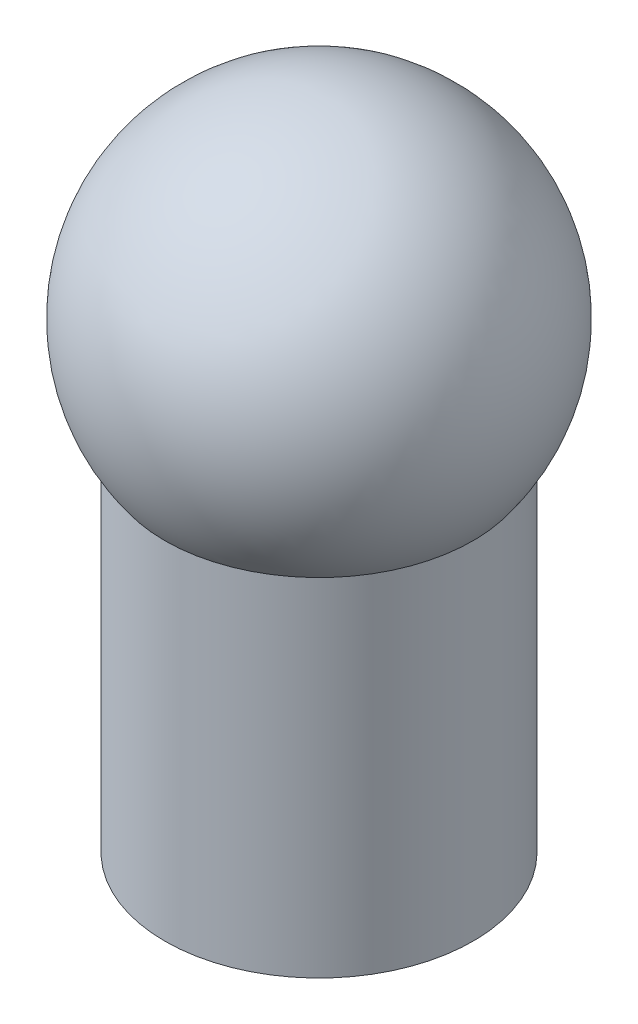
ISO-10303-21;
HEADER;
FILE_DESCRIPTION(('STEP AP214'),'2;1');
FILE_NAME('part.step','',(''),(''),'','','');
FILE_SCHEMA(('AUTOMOTIVE_DESIGN { 1 0 10303 214 1 1 1 1 }'));
ENDSEC;
DATA;
#1=APPLICATION_CONTEXT('core data for automotive mechanical design processes');
#2=APPLICATION_PROTOCOL_DEFINITION('international standard','automotive_design',2000,#1);
#3=PRODUCT_CONTEXT('',#1,'mechanical');
#4=PRODUCT('Part','Part','',(#3));
#5=PRODUCT_RELATED_PRODUCT_CATEGORY('part','',(#4));
#6=PRODUCT_DEFINITION_FORMATION('','',#4);
#7=PRODUCT_DEFINITION_CONTEXT('part definition',#1,'design');
#8=PRODUCT_DEFINITION('design','',#6,#7);
#9=PRODUCT_DEFINITION_SHAPE('','',#8);
#10=(LENGTH_UNIT() NAMED_UNIT(*) SI_UNIT(.MILLI.,.METRE.));
#11=(NAMED_UNIT(*) PLANE_ANGLE_UNIT() SI_UNIT($,.RADIAN.));
#12=(NAMED_UNIT(*) SI_UNIT($,.STERADIAN.) SOLID_ANGLE_UNIT());
#13=UNCERTAINTY_MEASURE_WITH_UNIT(LENGTH_MEASURE(1.E-05),#10,'distance_accuracy_value','');
#14=(GEOMETRIC_REPRESENTATION_CONTEXT(3) GLOBAL_UNCERTAINTY_ASSIGNED_CONTEXT((#13)) GLOBAL_UNIT_ASSIGNED_CONTEXT((#10,
#11,#12)) REPRESENTATION_CONTEXT('',''));
#15=CARTESIAN_POINT('',(0.,0.,0.));
#16=DIRECTION('',(0.,0.,1.));
#17=DIRECTION('',(1.,0.,0.));
#18=AXIS2_PLACEMENT_3D('',#15,#16,#17);
#19=CARTESIAN_POINT('',(0.,-12.,0.));
#20=DIRECTION('',(0.,1.,0.));
#21=DIRECTION('',(0.,0.,1.));
#22=AXIS2_PLACEMENT_3D('',#19,#20,#21);
#23=CYLINDRICAL_SURFACE('',#22,4.);
#24=CARTESIAN_POINT('',(0.,-12.,0.));
#25=DIRECTION('',(0.,1.,0.));
#26=DIRECTION('',(0.,0.,1.));
#27=AXIS2_PLACEMENT_3D('',#24,#25,#26);
#28=CIRCLE('',#27,4.);
#29=CARTESIAN_POINT('',(0.,-12.,4.));
#30=VERTEX_POINT('',#29);
#31=EDGE_CURVE('E37',#30,#30,#28,.T.);
#32=ORIENTED_EDGE('',*,*,#31,.T.);
#33=EDGE_LOOP('',(#32));
#34=FACE_BOUND('',#33,.T.);
#35=CARTESIAN_POINT('',(0.,-3.,0.));
#36=DIRECTION('',(0.,1.,0.));
#37=DIRECTION('',(0.,0.,1.));
#38=AXIS2_PLACEMENT_3D('',#35,#36,#37);
#39=CIRCLE('',#38,4.);
#40=CARTESIAN_POINT('',(0.,-3.,4.));
#41=VERTEX_POINT('',#40);
#42=EDGE_CURVE('E10',#41,#41,#39,.T.);
#43=ORIENTED_EDGE('',*,*,#42,.F.);
#44=EDGE_LOOP('',(#43));
#45=FACE_BOUND('',#44,.T.);
#46=ADVANCED_FACE('F30',(#34,#45),#23,.T.);
#47=CARTESIAN_POINT('',(0.,-12.,0.));
#48=DIRECTION('',(0.,1.,0.));
#49=DIRECTION('',(0.,0.,1.));
#50=AXIS2_PLACEMENT_3D('',#47,#48,#49);
#51=PLANE('',#50);
#52=ORIENTED_EDGE('',*,*,#31,.F.);
#53=EDGE_LOOP('',(#52));
#54=FACE_BOUND('',#53,.T.);
#55=ADVANCED_FACE('F45',(#54),#51,.F.);
#56=CARTESIAN_POINT('',(0.,0.,0.));
#57=DIRECTION('',(0.,0.,-1.));
#58=DIRECTION('',(1.,0.,0.));
#59=AXIS2_PLACEMENT_3D('',#56,#57,#58);
#60=SPHERICAL_SURFACE('',#59,5.);
#61=CARTESIAN_POINT('',(0.,0.,0.));
#62=DIRECTION('',(0.,1.,0.));
#63=DIRECTION('',(0.,0.,1.));
#64=AXIS2_PLACEMENT_3D('',#61,#62,#63);
#65=SPHERICAL_SURFACE('',#64,5.);
#66=ORIENTED_EDGE('',*,*,#42,.T.);
#67=EDGE_LOOP('',(#66));
#68=FACE_BOUND('',#67,.T.);
#69=ADVANCED_FACE('F32',(#68),#65,.T.);
#70=CLOSED_SHELL('',(#46,#55,#69));
#71=MANIFOLD_SOLID_BREP('B2',#70);
#72=ADVANCED_BREP_SHAPE_REPRESENTATION('',(#18,#71),#14);
#73=SHAPE_DEFINITION_REPRESENTATION(#9,#72);
ENDSEC;
END-ISO-10303-21;
